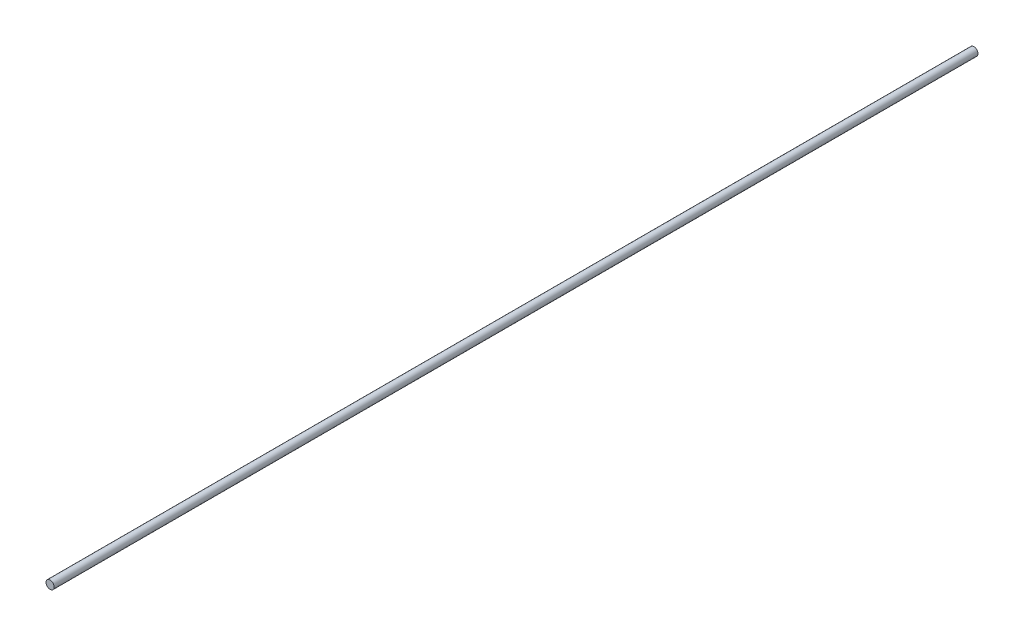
from build123d import *

# Parameters (mm, degrees)
SKETCH1_R      = 6.35
EXTRUDE1_DEPTH = 720.725


with BuildPart() as part:
    # Sketch1 → Extrude1 (new, symmetric)
    with BuildSketch(Plane.XY):
        Circle(SKETCH1_R)
    extrude(amount=EXTRUDE1_DEPTH, both=True)


solid = part.part
